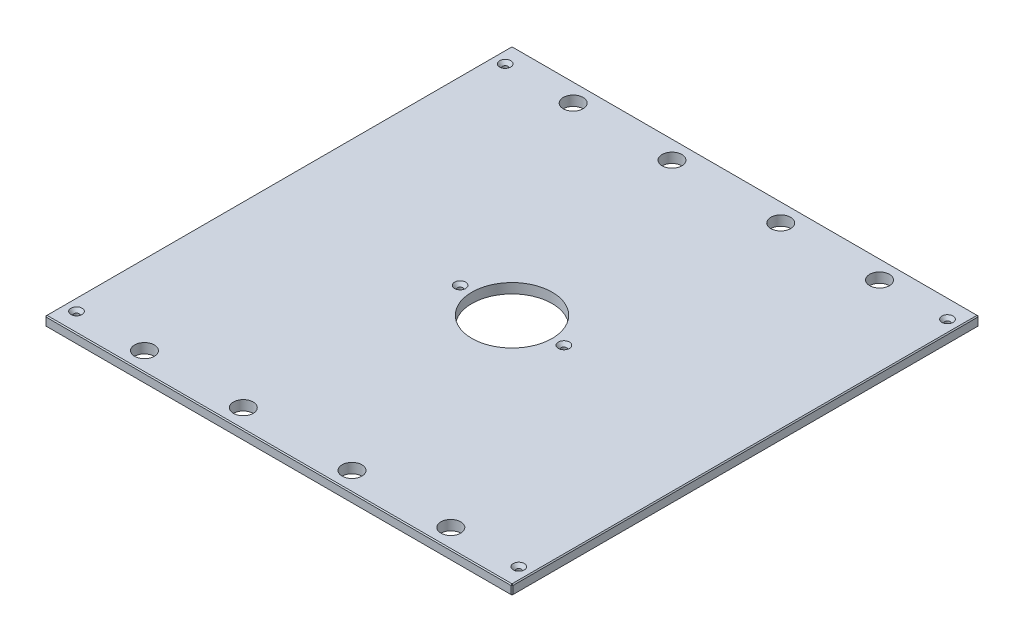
ISO-10303-21;
HEADER;
FILE_DESCRIPTION(('STEP AP214'),'2;1');
FILE_NAME('part.step','',(''),(''),'','','');
FILE_SCHEMA(('AUTOMOTIVE_DESIGN { 1 0 10303 214 1 1 1 1 }'));
ENDSEC;
DATA;
#1=APPLICATION_CONTEXT('core data for automotive mechanical design processes');
#2=APPLICATION_PROTOCOL_DEFINITION('international standard','automotive_design',2000,#1);
#3=PRODUCT_CONTEXT('',#1,'mechanical');
#4=PRODUCT('Part','Part','',(#3));
#5=PRODUCT_RELATED_PRODUCT_CATEGORY('part','',(#4));
#6=PRODUCT_DEFINITION_FORMATION('','',#4);
#7=PRODUCT_DEFINITION_CONTEXT('part definition',#1,'design');
#8=PRODUCT_DEFINITION('design','',#6,#7);
#9=PRODUCT_DEFINITION_SHAPE('','',#8);
#10=(LENGTH_UNIT() NAMED_UNIT(*) SI_UNIT(.MILLI.,.METRE.));
#11=(NAMED_UNIT(*) PLANE_ANGLE_UNIT() SI_UNIT($,.RADIAN.));
#12=(NAMED_UNIT(*) SI_UNIT($,.STERADIAN.) SOLID_ANGLE_UNIT());
#13=UNCERTAINTY_MEASURE_WITH_UNIT(LENGTH_MEASURE(1.E-05),#10,'distance_accuracy_value','');
#14=(GEOMETRIC_REPRESENTATION_CONTEXT(3) GLOBAL_UNCERTAINTY_ASSIGNED_CONTEXT((#13)) GLOBAL_UNIT_ASSIGNED_CONTEXT((#10,
#11,#12)) REPRESENTATION_CONTEXT('',''));
#15=CARTESIAN_POINT('',(0.,0.,0.));
#16=DIRECTION('',(0.,0.,1.));
#17=DIRECTION('',(1.,0.,0.));
#18=AXIS2_PLACEMENT_3D('',#15,#16,#17);
#19=CARTESIAN_POINT('',(-300.0375,12.7,-300.0375));
#20=DIRECTION('',(1.,0.,0.));
#21=DIRECTION('',(0.,0.,-1.));
#22=AXIS2_PLACEMENT_3D('',#19,#20,#21);
#23=PLANE('',#22);
#24=DIRECTION('',(0.,0.,-1.));
#25=VECTOR('',#24,1.);
#26=CARTESIAN_POINT('',(-300.0375,11.4299999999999,-300.0375));
#27=LINE('',#26,#25);
#28=CARTESIAN_POINT('',(-300.0375,11.4299999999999,298.7675));
#29=VERTEX_POINT('',#28);
#30=CARTESIAN_POINT('',(-300.0375,11.4299999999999,-298.7675));
#31=VERTEX_POINT('',#30);
#32=EDGE_CURVE('E135',#29,#31,#27,.T.);
#33=ORIENTED_EDGE('',*,*,#32,.T.);
#34=DIRECTION('',(0.,-1.,0.));
#35=VECTOR('',#34,1.);
#36=CARTESIAN_POINT('',(-300.0375,12.7,-298.7675));
#37=LINE('',#36,#35);
#38=CARTESIAN_POINT('',(-300.0375,1.2700000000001,-298.7675));
#39=VERTEX_POINT('',#38);
#40=EDGE_CURVE('E131',#31,#39,#37,.T.);
#41=ORIENTED_EDGE('',*,*,#40,.T.);
#42=DIRECTION('',(0.,0.,1.));
#43=VECTOR('',#42,1.);
#44=CARTESIAN_POINT('',(-300.0375,1.2700000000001,-300.0375));
#45=LINE('',#44,#43);
#46=CARTESIAN_POINT('',(-300.0375,1.2700000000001,298.7675));
#47=VERTEX_POINT('',#46);
#48=EDGE_CURVE('E126',#39,#47,#45,.T.);
#49=ORIENTED_EDGE('',*,*,#48,.T.);
#50=DIRECTION('',(0.,1.,0.));
#51=VECTOR('',#50,1.);
#52=CARTESIAN_POINT('',(-300.0375,12.7,298.7675));
#53=LINE('',#52,#51);
#54=EDGE_CURVE('E128',#47,#29,#53,.T.);
#55=ORIENTED_EDGE('',*,*,#54,.T.);
#56=EDGE_LOOP('',(#33,#41,#49,#55));
#57=FACE_BOUND('',#56,.T.);
#58=ADVANCED_FACE('F35',(#57),#23,.F.);
#59=CARTESIAN_POINT('',(-300.0375,12.7,300.0375));
#60=DIRECTION('',(0.,0.,-1.));
#61=DIRECTION('',(-1.,0.,0.));
#62=AXIS2_PLACEMENT_3D('',#59,#60,#61);
#63=PLANE('',#62);
#64=DIRECTION('',(1.,0.,0.));
#65=VECTOR('',#64,1.);
#66=CARTESIAN_POINT('',(-300.0375,1.2700000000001,300.0375));
#67=LINE('',#66,#65);
#68=CARTESIAN_POINT('',(-298.7675,1.2700000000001,300.0375));
#69=VERTEX_POINT('',#68);
#70=CARTESIAN_POINT('',(298.7675,1.2700000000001,300.0375));
#71=VERTEX_POINT('',#70);
#72=EDGE_CURVE('E58',#69,#71,#67,.T.);
#73=ORIENTED_EDGE('',*,*,#72,.T.);
#74=DIRECTION('',(0.,1.,0.));
#75=VECTOR('',#74,1.);
#76=CARTESIAN_POINT('',(298.7675,12.7,300.0375));
#77=LINE('',#76,#75);
#78=CARTESIAN_POINT('',(298.7675,11.4299999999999,300.0375));
#79=VERTEX_POINT('',#78);
#80=EDGE_CURVE('E11',#71,#79,#77,.T.);
#81=ORIENTED_EDGE('',*,*,#80,.T.);
#82=DIRECTION('',(-1.,0.,0.));
#83=VECTOR('',#82,1.);
#84=CARTESIAN_POINT('',(-300.0375,11.4299999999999,300.0375));
#85=LINE('',#84,#83);
#86=CARTESIAN_POINT('',(-298.7675,11.4299999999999,300.0375));
#87=VERTEX_POINT('',#86);
#88=EDGE_CURVE('E44',#79,#87,#85,.T.);
#89=ORIENTED_EDGE('',*,*,#88,.T.);
#90=DIRECTION('',(0.,-1.,0.));
#91=VECTOR('',#90,1.);
#92=CARTESIAN_POINT('',(-298.7675,12.7,300.0375));
#93=LINE('',#92,#91);
#94=EDGE_CURVE('E303',#87,#69,#93,.T.);
#95=ORIENTED_EDGE('',*,*,#94,.T.);
#96=EDGE_LOOP('',(#73,#81,#89,#95));
#97=FACE_BOUND('',#96,.T.);
#98=ADVANCED_FACE('F372',(#97),#63,.F.);
#99=CARTESIAN_POINT('',(300.0375,12.7,-300.0375));
#100=DIRECTION('',(-1.,0.,0.));
#101=DIRECTION('',(0.,0.,1.));
#102=AXIS2_PLACEMENT_3D('',#99,#100,#101);
#103=PLANE('',#102);
#104=DIRECTION('',(0.,0.,-1.));
#105=VECTOR('',#104,1.);
#106=CARTESIAN_POINT('',(300.0375,1.2700000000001,-300.0375));
#107=LINE('',#106,#105);
#108=CARTESIAN_POINT('',(300.0375,1.2700000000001,298.7675));
#109=VERTEX_POINT('',#108);
#110=CARTESIAN_POINT('',(300.0375,1.2700000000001,-298.7675));
#111=VERTEX_POINT('',#110);
#112=EDGE_CURVE('E298',#109,#111,#107,.T.);
#113=ORIENTED_EDGE('',*,*,#112,.T.);
#114=DIRECTION('',(0.,1.,0.));
#115=VECTOR('',#114,1.);
#116=CARTESIAN_POINT('',(300.0375,12.7,-298.7675));
#117=LINE('',#116,#115);
#118=CARTESIAN_POINT('',(300.0375,11.4299999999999,-298.7675));
#119=VERTEX_POINT('',#118);
#120=EDGE_CURVE('E300',#111,#119,#117,.T.);
#121=ORIENTED_EDGE('',*,*,#120,.T.);
#122=DIRECTION('',(0.,0.,1.));
#123=VECTOR('',#122,1.);
#124=CARTESIAN_POINT('',(300.0375,11.4299999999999,300.0375));
#125=LINE('',#124,#123);
#126=CARTESIAN_POINT('',(300.0375,11.4299999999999,298.7675));
#127=VERTEX_POINT('',#126);
#128=EDGE_CURVE('E296',#119,#127,#125,.T.);
#129=ORIENTED_EDGE('',*,*,#128,.T.);
#130=DIRECTION('',(0.,-1.,0.));
#131=VECTOR('',#130,1.);
#132=CARTESIAN_POINT('',(300.0375,12.7,298.7675));
#133=LINE('',#132,#131);
#134=EDGE_CURVE('E294',#127,#109,#133,.T.);
#135=ORIENTED_EDGE('',*,*,#134,.T.);
#136=EDGE_LOOP('',(#113,#121,#129,#135));
#137=FACE_BOUND('',#136,.T.);
#138=ADVANCED_FACE('F359',(#137),#103,.F.);
#139=CARTESIAN_POINT('',(-300.0375,12.7,-300.0375));
#140=DIRECTION('',(0.,0.,1.));
#141=DIRECTION('',(1.,0.,0.));
#142=AXIS2_PLACEMENT_3D('',#139,#140,#141);
#143=PLANE('',#142);
#144=DIRECTION('',(-1.,0.,0.));
#145=VECTOR('',#144,1.);
#146=CARTESIAN_POINT('',(-300.0375,1.2700000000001,-300.0375));
#147=LINE('',#146,#145);
#148=CARTESIAN_POINT('',(298.7675,1.2700000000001,-300.0375));
#149=VERTEX_POINT('',#148);
#150=CARTESIAN_POINT('',(-298.7675,1.2700000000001,-300.0375));
#151=VERTEX_POINT('',#150);
#152=EDGE_CURVE('E270',#149,#151,#147,.T.);
#153=ORIENTED_EDGE('',*,*,#152,.T.);
#154=DIRECTION('',(0.,1.,0.));
#155=VECTOR('',#154,1.);
#156=CARTESIAN_POINT('',(-298.7675,12.7,-300.0375));
#157=LINE('',#156,#155);
#158=CARTESIAN_POINT('',(-298.7675,11.4299999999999,-300.0375));
#159=VERTEX_POINT('',#158);
#160=EDGE_CURVE('E274',#151,#159,#157,.T.);
#161=ORIENTED_EDGE('',*,*,#160,.T.);
#162=DIRECTION('',(1.,0.,0.));
#163=VECTOR('',#162,1.);
#164=CARTESIAN_POINT('',(300.0375,11.4299999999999,-300.0375));
#165=LINE('',#164,#163);
#166=CARTESIAN_POINT('',(298.7675,11.4299999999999,-300.0375));
#167=VERTEX_POINT('',#166);
#168=EDGE_CURVE('E272',#159,#167,#165,.T.);
#169=ORIENTED_EDGE('',*,*,#168,.T.);
#170=DIRECTION('',(0.,-1.,0.));
#171=VECTOR('',#170,1.);
#172=CARTESIAN_POINT('',(298.7675,12.7,-300.0375));
#173=LINE('',#172,#171);
#174=EDGE_CURVE('E268',#167,#149,#173,.T.);
#175=ORIENTED_EDGE('',*,*,#174,.T.);
#176=EDGE_LOOP('',(#153,#161,#169,#175));
#177=FACE_BOUND('',#176,.T.);
#178=ADVANCED_FACE('F333',(#177),#143,.F.);
#179=CARTESIAN_POINT('',(0.,12.7,0.));
#180=DIRECTION('',(0.,1.,0.));
#181=DIRECTION('',(0.,0.,1.));
#182=AXIS2_PLACEMENT_3D('',#179,#180,#181);
#183=PLANE('',#182);
#184=CARTESIAN_POINT('',(284.1625,12.7,-275.42998));
#185=DIRECTION('',(0.,1.,0.));
#186=DIRECTION('',(0.,0.,1.));
#187=AXIS2_PLACEMENT_3D('',#184,#185,#186);
#188=CIRCLE('',#187,7.13740000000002);
#189=CARTESIAN_POINT('',(284.1625,12.7,-268.29258));
#190=VERTEX_POINT('',#189);
#191=EDGE_CURVE('E816',#190,#190,#188,.T.);
#192=ORIENTED_EDGE('',*,*,#191,.F.);
#193=EDGE_LOOP('',(#192));
#194=FACE_BOUND('',#193,.T.);
#195=CARTESIAN_POINT('',(284.1625,12.7,275.42998));
#196=DIRECTION('',(0.,1.,0.));
#197=DIRECTION('',(0.,0.,1.));
#198=AXIS2_PLACEMENT_3D('',#195,#196,#197);
#199=CIRCLE('',#198,7.13740000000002);
#200=CARTESIAN_POINT('',(284.1625,12.7,282.56738));
#201=VERTEX_POINT('',#200);
#202=EDGE_CURVE('E820',#201,#201,#199,.T.);
#203=ORIENTED_EDGE('',*,*,#202,.F.);
#204=EDGE_LOOP('',(#203));
#205=FACE_BOUND('',#204,.T.);
#206=CARTESIAN_POINT('',(-284.1625,12.7,275.42998));
#207=DIRECTION('',(0.,1.,0.));
#208=DIRECTION('',(0.,0.,1.));
#209=AXIS2_PLACEMENT_3D('',#206,#207,#208);
#210=CIRCLE('',#209,7.13740000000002);
#211=CARTESIAN_POINT('',(-284.1625,12.7,282.56738));
#212=VERTEX_POINT('',#211);
#213=EDGE_CURVE('E824',#212,#212,#210,.T.);
#214=ORIENTED_EDGE('',*,*,#213,.F.);
#215=EDGE_LOOP('',(#214));
#216=FACE_BOUND('',#215,.T.);
#217=CARTESIAN_POINT('',(-66.675,12.7,0.));
#218=DIRECTION('',(0.,1.,0.));
#219=DIRECTION('',(0.,0.,1.));
#220=AXIS2_PLACEMENT_3D('',#217,#218,#219);
#221=CIRCLE('',#220,7.1374);
#222=CARTESIAN_POINT('',(-66.675,12.7,7.1374));
#223=VERTEX_POINT('',#222);
#224=EDGE_CURVE('E828',#223,#223,#221,.T.);
#225=ORIENTED_EDGE('',*,*,#224,.F.);
#226=EDGE_LOOP('',(#225));
#227=FACE_BOUND('',#226,.T.);
#228=CARTESIAN_POINT('',(66.675,12.7,0.));
#229=DIRECTION('',(0.,1.,0.));
#230=DIRECTION('',(0.,0.,1.));
#231=AXIS2_PLACEMENT_3D('',#228,#229,#230);
#232=CIRCLE('',#231,7.1374);
#233=CARTESIAN_POINT('',(66.675,12.7,7.1374));
#234=VERTEX_POINT('',#233);
#235=EDGE_CURVE('E832',#234,#234,#232,.T.);
#236=ORIENTED_EDGE('',*,*,#235,.F.);
#237=EDGE_LOOP('',(#236));
#238=FACE_BOUND('',#237,.T.);
#239=CARTESIAN_POINT('',(-284.1625,12.7,-275.42998));
#240=DIRECTION('',(0.,1.,0.));
#241=DIRECTION('',(0.,0.,1.));
#242=AXIS2_PLACEMENT_3D('',#239,#240,#241);
#243=CIRCLE('',#242,7.13740000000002);
#244=CARTESIAN_POINT('',(-284.1625,12.7,-268.29258));
#245=VERTEX_POINT('',#244);
#246=EDGE_CURVE('E835',#245,#245,#243,.T.);
#247=ORIENTED_EDGE('',*,*,#246,.F.);
#248=EDGE_LOOP('',(#247));
#249=FACE_BOUND('',#248,.T.);
#250=DIRECTION('',(0.,0.,-1.));
#251=VECTOR('',#250,1.);
#252=CARTESIAN_POINT('',(298.7675,12.7,-300.0375));
#253=LINE('',#252,#251);
#254=CARTESIAN_POINT('',(298.7675,12.7,298.7675));
#255=VERTEX_POINT('',#254);
#256=CARTESIAN_POINT('',(298.7675,12.7,-298.7675));
#257=VERTEX_POINT('',#256);
#258=EDGE_CURVE('E281',#255,#257,#253,.T.);
#259=ORIENTED_EDGE('',*,*,#258,.T.);
#260=DIRECTION('',(-1.,0.,0.));
#261=VECTOR('',#260,1.);
#262=CARTESIAN_POINT('',(-300.0375,12.7,-298.7675));
#263=LINE('',#262,#261);
#264=CARTESIAN_POINT('',(-298.7675,12.7,-298.7675));
#265=VERTEX_POINT('',#264);
#266=EDGE_CURVE('E283',#257,#265,#263,.T.);
#267=ORIENTED_EDGE('',*,*,#266,.T.);
#268=DIRECTION('',(0.,0.,1.));
#269=VECTOR('',#268,1.);
#270=CARTESIAN_POINT('',(-298.7675,12.7,300.0375));
#271=LINE('',#270,#269);
#272=CARTESIAN_POINT('',(-298.7675,12.7,298.7675));
#273=VERTEX_POINT('',#272);
#274=EDGE_CURVE('E279',#265,#273,#271,.T.);
#275=ORIENTED_EDGE('',*,*,#274,.T.);
#276=DIRECTION('',(1.,0.,0.));
#277=VECTOR('',#276,1.);
#278=CARTESIAN_POINT('',(300.0375,12.7,298.7675));
#279=LINE('',#278,#277);
#280=EDGE_CURVE('E277',#273,#255,#279,.T.);
#281=ORIENTED_EDGE('',*,*,#280,.T.);
#282=EDGE_LOOP('',(#259,#267,#275,#281));
#283=FACE_BOUND('',#282,.T.);
#284=CARTESIAN_POINT('',(196.85,12.7,-275.42998));
#285=DIRECTION('',(0.,1.,0.));
#286=DIRECTION('',(0.,0.,1.));
#287=AXIS2_PLACEMENT_3D('',#284,#285,#286);
#288=CIRCLE('',#287,12.7);
#289=CARTESIAN_POINT('',(196.85,12.7,-262.72998));
#290=VERTEX_POINT('',#289);
#291=EDGE_CURVE('E204',#290,#290,#288,.T.);
#292=ORIENTED_EDGE('',*,*,#291,.F.);
#293=EDGE_LOOP('',(#292));
#294=FACE_BOUND('',#293,.T.);
#295=CARTESIAN_POINT('',(-196.85,12.7,-275.42998));
#296=DIRECTION('',(0.,1.,0.));
#297=DIRECTION('',(0.,0.,1.));
#298=AXIS2_PLACEMENT_3D('',#295,#296,#297);
#299=CIRCLE('',#298,12.7);
#300=CARTESIAN_POINT('',(-196.85,12.7,-262.72998));
#301=VERTEX_POINT('',#300);
#302=EDGE_CURVE('E214',#301,#301,#299,.T.);
#303=ORIENTED_EDGE('',*,*,#302,.F.);
#304=EDGE_LOOP('',(#303));
#305=FACE_BOUND('',#304,.T.);
#306=CARTESIAN_POINT('',(196.85,12.7,275.42998));
#307=DIRECTION('',(0.,1.,0.));
#308=DIRECTION('',(0.,0.,1.));
#309=AXIS2_PLACEMENT_3D('',#306,#307,#308);
#310=CIRCLE('',#309,12.7);
#311=CARTESIAN_POINT('',(196.85,12.7,288.12998));
#312=VERTEX_POINT('',#311);
#313=EDGE_CURVE('E225',#312,#312,#310,.T.);
#314=ORIENTED_EDGE('',*,*,#313,.F.);
#315=EDGE_LOOP('',(#314));
#316=FACE_BOUND('',#315,.T.);
#317=CARTESIAN_POINT('',(-196.85,12.7,275.42998));
#318=DIRECTION('',(0.,1.,0.));
#319=DIRECTION('',(0.,0.,1.));
#320=AXIS2_PLACEMENT_3D('',#317,#318,#319);
#321=CIRCLE('',#320,12.7);
#322=CARTESIAN_POINT('',(-196.85,12.7,288.12998));
#323=VERTEX_POINT('',#322);
#324=EDGE_CURVE('E231',#323,#323,#321,.T.);
#325=ORIENTED_EDGE('',*,*,#324,.F.);
#326=EDGE_LOOP('',(#325));
#327=FACE_BOUND('',#326,.T.);
#328=CARTESIAN_POINT('',(-69.85,12.7,-275.42998));
#329=DIRECTION('',(0.,1.,0.));
#330=DIRECTION('',(0.,0.,1.));
#331=AXIS2_PLACEMENT_3D('',#328,#329,#330);
#332=CIRCLE('',#331,12.7);
#333=CARTESIAN_POINT('',(-69.85,12.7,-262.72998));
#334=VERTEX_POINT('',#333);
#335=EDGE_CURVE('E237',#334,#334,#332,.T.);
#336=ORIENTED_EDGE('',*,*,#335,.F.);
#337=EDGE_LOOP('',(#336));
#338=FACE_BOUND('',#337,.T.);
#339=CARTESIAN_POINT('',(69.85,12.7,-275.42998));
#340=DIRECTION('',(0.,1.,0.));
#341=DIRECTION('',(0.,0.,1.));
#342=AXIS2_PLACEMENT_3D('',#339,#340,#341);
#343=CIRCLE('',#342,12.7);
#344=CARTESIAN_POINT('',(69.85,12.7,-262.72998));
#345=VERTEX_POINT('',#344);
#346=EDGE_CURVE('E243',#345,#345,#343,.T.);
#347=ORIENTED_EDGE('',*,*,#346,.F.);
#348=EDGE_LOOP('',(#347));
#349=FACE_BOUND('',#348,.T.);
#350=CARTESIAN_POINT('',(69.85,12.7,275.42998));
#351=DIRECTION('',(0.,1.,0.));
#352=DIRECTION('',(0.,0.,1.));
#353=AXIS2_PLACEMENT_3D('',#350,#351,#352);
#354=CIRCLE('',#353,12.7);
#355=CARTESIAN_POINT('',(69.85,12.7,288.12998));
#356=VERTEX_POINT('',#355);
#357=EDGE_CURVE('E249',#356,#356,#354,.T.);
#358=ORIENTED_EDGE('',*,*,#357,.F.);
#359=EDGE_LOOP('',(#358));
#360=FACE_BOUND('',#359,.T.);
#361=CARTESIAN_POINT('',(-69.85,12.7,275.42998));
#362=DIRECTION('',(0.,1.,0.));
#363=DIRECTION('',(0.,0.,1.));
#364=AXIS2_PLACEMENT_3D('',#361,#362,#363);
#365=CIRCLE('',#364,12.7);
#366=CARTESIAN_POINT('',(-69.85,12.7,288.12998));
#367=VERTEX_POINT('',#366);
#368=EDGE_CURVE('E255',#367,#367,#365,.T.);
#369=ORIENTED_EDGE('',*,*,#368,.F.);
#370=EDGE_LOOP('',(#369));
#371=FACE_BOUND('',#370,.T.);
#372=CARTESIAN_POINT('',(0.,12.7,0.));
#373=DIRECTION('',(0.,1.,0.));
#374=DIRECTION('',(0.,0.,1.));
#375=AXIS2_PLACEMENT_3D('',#372,#373,#374);
#376=CIRCLE('',#375,51.562);
#377=CARTESIAN_POINT('',(0.,12.7,51.562));
#378=VERTEX_POINT('',#377);
#379=EDGE_CURVE('E261',#378,#378,#376,.T.);
#380=ORIENTED_EDGE('',*,*,#379,.F.);
#381=EDGE_LOOP('',(#380));
#382=FACE_BOUND('',#381,.T.);
#383=ADVANCED_FACE('F381',(#194,#205,#216,#227,#238,#249,#283,#294,#305,#316,#327,#338,#349,
#360,#371,#382),#183,.T.);
#384=CARTESIAN_POINT('',(0.,0.,0.));
#385=DIRECTION('',(0.,1.,0.));
#386=DIRECTION('',(0.,0.,1.));
#387=AXIS2_PLACEMENT_3D('',#384,#385,#386);
#388=PLANE('',#387);
#389=CARTESIAN_POINT('',(284.1625,0.,-275.42998));
#390=DIRECTION('',(0.,1.,0.));
#391=DIRECTION('',(0.,0.,1.));
#392=AXIS2_PLACEMENT_3D('',#389,#390,#391);
#393=CIRCLE('',#392,3.3782);
#394=CARTESIAN_POINT('',(284.1625,0.,-272.05178));
#395=VERTEX_POINT('',#394);
#396=EDGE_CURVE('E869',#395,#395,#393,.T.);
#397=ORIENTED_EDGE('',*,*,#396,.T.);
#398=EDGE_LOOP('',(#397));
#399=FACE_BOUND('',#398,.T.);
#400=CARTESIAN_POINT('',(284.1625,0.,275.42998));
#401=DIRECTION('',(0.,1.,0.));
#402=DIRECTION('',(0.,0.,1.));
#403=AXIS2_PLACEMENT_3D('',#400,#401,#402);
#404=CIRCLE('',#403,3.3782);
#405=CARTESIAN_POINT('',(284.1625,0.,278.80818));
#406=VERTEX_POINT('',#405);
#407=EDGE_CURVE('E862',#406,#406,#404,.T.);
#408=ORIENTED_EDGE('',*,*,#407,.T.);
#409=EDGE_LOOP('',(#408));
#410=FACE_BOUND('',#409,.T.);
#411=CARTESIAN_POINT('',(-284.1625,0.,275.42998));
#412=DIRECTION('',(0.,1.,0.));
#413=DIRECTION('',(0.,0.,1.));
#414=AXIS2_PLACEMENT_3D('',#411,#412,#413);
#415=CIRCLE('',#414,3.3782);
#416=CARTESIAN_POINT('',(-284.1625,0.,278.80818));
#417=VERTEX_POINT('',#416);
#418=EDGE_CURVE('E855',#417,#417,#415,.T.);
#419=ORIENTED_EDGE('',*,*,#418,.T.);
#420=EDGE_LOOP('',(#419));
#421=FACE_BOUND('',#420,.T.);
#422=CARTESIAN_POINT('',(-66.675,0.,0.));
#423=DIRECTION('',(0.,1.,0.));
#424=DIRECTION('',(0.,0.,1.));
#425=AXIS2_PLACEMENT_3D('',#422,#423,#424);
#426=CIRCLE('',#425,3.3782);
#427=CARTESIAN_POINT('',(-66.675,0.,3.3782));
#428=VERTEX_POINT('',#427);
#429=EDGE_CURVE('E848',#428,#428,#426,.T.);
#430=ORIENTED_EDGE('',*,*,#429,.T.);
#431=EDGE_LOOP('',(#430));
#432=FACE_BOUND('',#431,.T.);
#433=CARTESIAN_POINT('',(66.675,0.,0.));
#434=DIRECTION('',(0.,1.,0.));
#435=DIRECTION('',(0.,0.,1.));
#436=AXIS2_PLACEMENT_3D('',#433,#434,#435);
#437=CIRCLE('',#436,3.3782);
#438=CARTESIAN_POINT('',(66.675,0.,3.3782));
#439=VERTEX_POINT('',#438);
#440=EDGE_CURVE('E838',#439,#439,#437,.T.);
#441=ORIENTED_EDGE('',*,*,#440,.T.);
#442=EDGE_LOOP('',(#441));
#443=FACE_BOUND('',#442,.T.);
#444=CARTESIAN_POINT('',(-284.1625,0.,-275.42998));
#445=DIRECTION('',(0.,1.,0.));
#446=DIRECTION('',(0.,0.,1.));
#447=AXIS2_PLACEMENT_3D('',#444,#445,#446);
#448=CIRCLE('',#447,3.3782);
#449=CARTESIAN_POINT('',(-284.1625,0.,-272.05178));
#450=VERTEX_POINT('',#449);
#451=EDGE_CURVE('E217',#450,#450,#448,.T.);
#452=ORIENTED_EDGE('',*,*,#451,.T.);
#453=EDGE_LOOP('',(#452));
#454=FACE_BOUND('',#453,.T.);
#455=DIRECTION('',(0.,0.,-1.));
#456=VECTOR('',#455,1.);
#457=CARTESIAN_POINT('',(-298.7675,0.,0.));
#458=LINE('',#457,#456);
#459=CARTESIAN_POINT('',(-298.7675,0.,298.7675));
#460=VERTEX_POINT('',#459);
#461=CARTESIAN_POINT('',(-298.7675,0.,-298.7675));
#462=VERTEX_POINT('',#461);
#463=EDGE_CURVE('E158',#460,#462,#458,.T.);
#464=ORIENTED_EDGE('',*,*,#463,.T.);
#465=DIRECTION('',(1.,0.,0.));
#466=VECTOR('',#465,1.);
#467=CARTESIAN_POINT('',(0.,0.,-298.7675));
#468=LINE('',#467,#466);
#469=CARTESIAN_POINT('',(298.7675,0.,-298.7675));
#470=VERTEX_POINT('',#469);
#471=EDGE_CURVE('E291',#462,#470,#468,.T.);
#472=ORIENTED_EDGE('',*,*,#471,.T.);
#473=DIRECTION('',(0.,0.,1.));
#474=VECTOR('',#473,1.);
#475=CARTESIAN_POINT('',(298.7675,0.,0.));
#476=LINE('',#475,#474);
#477=CARTESIAN_POINT('',(298.7675,0.,298.7675));
#478=VERTEX_POINT('',#477);
#479=EDGE_CURVE('E289',#470,#478,#476,.T.);
#480=ORIENTED_EDGE('',*,*,#479,.T.);
#481=DIRECTION('',(-1.,0.,0.));
#482=VECTOR('',#481,1.);
#483=CARTESIAN_POINT('',(0.,0.,298.7675));
#484=LINE('',#483,#482);
#485=EDGE_CURVE('E286',#478,#460,#484,.T.);
#486=ORIENTED_EDGE('',*,*,#485,.T.);
#487=EDGE_LOOP('',(#464,#472,#480,#486));
#488=FACE_BOUND('',#487,.T.);
#489=CARTESIAN_POINT('',(196.85,0.,-275.42998));
#490=DIRECTION('',(0.,1.,0.));
#491=DIRECTION('',(0.,0.,1.));
#492=AXIS2_PLACEMENT_3D('',#489,#490,#491);
#493=CIRCLE('',#492,12.7);
#494=CARTESIAN_POINT('',(196.85,0.,-262.72998));
#495=VERTEX_POINT('',#494);
#496=EDGE_CURVE('E209',#495,#495,#493,.T.);
#497=ORIENTED_EDGE('',*,*,#496,.T.);
#498=EDGE_LOOP('',(#497));
#499=FACE_BOUND('',#498,.T.);
#500=CARTESIAN_POINT('',(-196.85,0.,-275.42998));
#501=DIRECTION('',(0.,1.,0.));
#502=DIRECTION('',(0.,0.,1.));
#503=AXIS2_PLACEMENT_3D('',#500,#501,#502);
#504=CIRCLE('',#503,12.7);
#505=CARTESIAN_POINT('',(-196.85,0.,-262.72998));
#506=VERTEX_POINT('',#505);
#507=EDGE_CURVE('E222',#506,#506,#504,.T.);
#508=ORIENTED_EDGE('',*,*,#507,.T.);
#509=EDGE_LOOP('',(#508));
#510=FACE_BOUND('',#509,.T.);
#511=CARTESIAN_POINT('',(196.85,0.,275.42998));
#512=DIRECTION('',(0.,1.,0.));
#513=DIRECTION('',(0.,0.,1.));
#514=AXIS2_PLACEMENT_3D('',#511,#512,#513);
#515=CIRCLE('',#514,12.7);
#516=CARTESIAN_POINT('',(196.85,0.,288.12998));
#517=VERTEX_POINT('',#516);
#518=EDGE_CURVE('E228',#517,#517,#515,.T.);
#519=ORIENTED_EDGE('',*,*,#518,.T.);
#520=EDGE_LOOP('',(#519));
#521=FACE_BOUND('',#520,.T.);
#522=CARTESIAN_POINT('',(-196.85,0.,275.42998));
#523=DIRECTION('',(0.,1.,0.));
#524=DIRECTION('',(0.,0.,1.));
#525=AXIS2_PLACEMENT_3D('',#522,#523,#524);
#526=CIRCLE('',#525,12.7);
#527=CARTESIAN_POINT('',(-196.85,0.,288.12998));
#528=VERTEX_POINT('',#527);
#529=EDGE_CURVE('E234',#528,#528,#526,.T.);
#530=ORIENTED_EDGE('',*,*,#529,.T.);
#531=EDGE_LOOP('',(#530));
#532=FACE_BOUND('',#531,.T.);
#533=CARTESIAN_POINT('',(-69.85,0.,-275.42998));
#534=DIRECTION('',(0.,1.,0.));
#535=DIRECTION('',(0.,0.,1.));
#536=AXIS2_PLACEMENT_3D('',#533,#534,#535);
#537=CIRCLE('',#536,12.7);
#538=CARTESIAN_POINT('',(-69.85,0.,-262.72998));
#539=VERTEX_POINT('',#538);
#540=EDGE_CURVE('E240',#539,#539,#537,.T.);
#541=ORIENTED_EDGE('',*,*,#540,.T.);
#542=EDGE_LOOP('',(#541));
#543=FACE_BOUND('',#542,.T.);
#544=CARTESIAN_POINT('',(69.85,0.,-275.42998));
#545=DIRECTION('',(0.,1.,0.));
#546=DIRECTION('',(0.,0.,1.));
#547=AXIS2_PLACEMENT_3D('',#544,#545,#546);
#548=CIRCLE('',#547,12.7);
#549=CARTESIAN_POINT('',(69.85,0.,-262.72998));
#550=VERTEX_POINT('',#549);
#551=EDGE_CURVE('E246',#550,#550,#548,.T.);
#552=ORIENTED_EDGE('',*,*,#551,.T.);
#553=EDGE_LOOP('',(#552));
#554=FACE_BOUND('',#553,.T.);
#555=CARTESIAN_POINT('',(69.85,0.,275.42998));
#556=DIRECTION('',(0.,1.,0.));
#557=DIRECTION('',(0.,0.,1.));
#558=AXIS2_PLACEMENT_3D('',#555,#556,#557);
#559=CIRCLE('',#558,12.7);
#560=CARTESIAN_POINT('',(69.85,0.,288.12998));
#561=VERTEX_POINT('',#560);
#562=EDGE_CURVE('E252',#561,#561,#559,.T.);
#563=ORIENTED_EDGE('',*,*,#562,.T.);
#564=EDGE_LOOP('',(#563));
#565=FACE_BOUND('',#564,.T.);
#566=CARTESIAN_POINT('',(-69.85,0.,275.42998));
#567=DIRECTION('',(0.,1.,0.));
#568=DIRECTION('',(0.,0.,1.));
#569=AXIS2_PLACEMENT_3D('',#566,#567,#568);
#570=CIRCLE('',#569,12.7);
#571=CARTESIAN_POINT('',(-69.85,0.,288.12998));
#572=VERTEX_POINT('',#571);
#573=EDGE_CURVE('E258',#572,#572,#570,.T.);
#574=ORIENTED_EDGE('',*,*,#573,.T.);
#575=EDGE_LOOP('',(#574));
#576=FACE_BOUND('',#575,.T.);
#577=CARTESIAN_POINT('',(0.,0.,0.));
#578=DIRECTION('',(0.,1.,0.));
#579=DIRECTION('',(0.,0.,1.));
#580=AXIS2_PLACEMENT_3D('',#577,#578,#579);
#581=CIRCLE('',#580,51.562);
#582=CARTESIAN_POINT('',(0.,0.,51.562));
#583=VERTEX_POINT('',#582);
#584=EDGE_CURVE('E147',#583,#583,#581,.T.);
#585=ORIENTED_EDGE('',*,*,#584,.T.);
#586=EDGE_LOOP('',(#585));
#587=FACE_BOUND('',#586,.T.);
#588=ADVANCED_FACE('F346',(#399,#410,#421,#432,#443,#454,#488,#499,#510,#521,#532,#543,#554,
#565,#576,#587),#388,.F.);
#589=CARTESIAN_POINT('',(0.,0.,0.));
#590=DIRECTION('',(0.,1.,0.));
#591=DIRECTION('',(0.,0.,1.));
#592=AXIS2_PLACEMENT_3D('',#589,#590,#591);
#593=CYLINDRICAL_SURFACE('',#592,51.562);
#594=ORIENTED_EDGE('',*,*,#584,.F.);
#595=EDGE_LOOP('',(#594));
#596=FACE_BOUND('',#595,.T.);
#597=ORIENTED_EDGE('',*,*,#379,.T.);
#598=EDGE_LOOP('',(#597));
#599=FACE_BOUND('',#598,.T.);
#600=ADVANCED_FACE('F751',(#596,#599),#593,.F.);
#601=CARTESIAN_POINT('',(-69.85,12.7,275.42998));
#602=DIRECTION('',(0.,1.,0.));
#603=DIRECTION('',(0.,0.,1.));
#604=AXIS2_PLACEMENT_3D('',#601,#602,#603);
#605=CYLINDRICAL_SURFACE('',#604,12.7);
#606=ORIENTED_EDGE('',*,*,#573,.F.);
#607=EDGE_LOOP('',(#606));
#608=FACE_BOUND('',#607,.T.);
#609=ORIENTED_EDGE('',*,*,#368,.T.);
#610=EDGE_LOOP('',(#609));
#611=FACE_BOUND('',#610,.T.);
#612=ADVANCED_FACE('F742',(#608,#611),#605,.F.);
#613=CARTESIAN_POINT('',(69.85,12.7,275.42998));
#614=DIRECTION('',(0.,1.,0.));
#615=DIRECTION('',(0.,0.,1.));
#616=AXIS2_PLACEMENT_3D('',#613,#614,#615);
#617=CYLINDRICAL_SURFACE('',#616,12.7);
#618=ORIENTED_EDGE('',*,*,#562,.F.);
#619=EDGE_LOOP('',(#618));
#620=FACE_BOUND('',#619,.T.);
#621=ORIENTED_EDGE('',*,*,#357,.T.);
#622=EDGE_LOOP('',(#621));
#623=FACE_BOUND('',#622,.T.);
#624=ADVANCED_FACE('F733',(#620,#623),#617,.F.);
#625=CARTESIAN_POINT('',(69.85,12.7,-275.42998));
#626=DIRECTION('',(0.,1.,0.));
#627=DIRECTION('',(0.,0.,1.));
#628=AXIS2_PLACEMENT_3D('',#625,#626,#627);
#629=CYLINDRICAL_SURFACE('',#628,12.7);
#630=ORIENTED_EDGE('',*,*,#551,.F.);
#631=EDGE_LOOP('',(#630));
#632=FACE_BOUND('',#631,.T.);
#633=ORIENTED_EDGE('',*,*,#346,.T.);
#634=EDGE_LOOP('',(#633));
#635=FACE_BOUND('',#634,.T.);
#636=ADVANCED_FACE('F724',(#632,#635),#629,.F.);
#637=CARTESIAN_POINT('',(-69.85,12.7,-275.42998));
#638=DIRECTION('',(0.,1.,0.));
#639=DIRECTION('',(0.,0.,1.));
#640=AXIS2_PLACEMENT_3D('',#637,#638,#639);
#641=CYLINDRICAL_SURFACE('',#640,12.7);
#642=ORIENTED_EDGE('',*,*,#540,.F.);
#643=EDGE_LOOP('',(#642));
#644=FACE_BOUND('',#643,.T.);
#645=ORIENTED_EDGE('',*,*,#335,.T.);
#646=EDGE_LOOP('',(#645));
#647=FACE_BOUND('',#646,.T.);
#648=ADVANCED_FACE('F715',(#644,#647),#641,.F.);
#649=CARTESIAN_POINT('',(-196.85,12.7,275.42998));
#650=DIRECTION('',(0.,1.,0.));
#651=DIRECTION('',(0.,0.,1.));
#652=AXIS2_PLACEMENT_3D('',#649,#650,#651);
#653=CYLINDRICAL_SURFACE('',#652,12.7);
#654=ORIENTED_EDGE('',*,*,#529,.F.);
#655=EDGE_LOOP('',(#654));
#656=FACE_BOUND('',#655,.T.);
#657=ORIENTED_EDGE('',*,*,#324,.T.);
#658=EDGE_LOOP('',(#657));
#659=FACE_BOUND('',#658,.T.);
#660=ADVANCED_FACE('F706',(#656,#659),#653,.F.);
#661=CARTESIAN_POINT('',(196.85,12.7,275.42998));
#662=DIRECTION('',(0.,1.,0.));
#663=DIRECTION('',(0.,0.,1.));
#664=AXIS2_PLACEMENT_3D('',#661,#662,#663);
#665=CYLINDRICAL_SURFACE('',#664,12.7);
#666=ORIENTED_EDGE('',*,*,#518,.F.);
#667=EDGE_LOOP('',(#666));
#668=FACE_BOUND('',#667,.T.);
#669=ORIENTED_EDGE('',*,*,#313,.T.);
#670=EDGE_LOOP('',(#669));
#671=FACE_BOUND('',#670,.T.);
#672=ADVANCED_FACE('F697',(#668,#671),#665,.F.);
#673=CARTESIAN_POINT('',(-196.85,12.7,-275.42998));
#674=DIRECTION('',(0.,1.,0.));
#675=DIRECTION('',(0.,0.,1.));
#676=AXIS2_PLACEMENT_3D('',#673,#674,#675);
#677=CYLINDRICAL_SURFACE('',#676,12.7);
#678=ORIENTED_EDGE('',*,*,#507,.F.);
#679=EDGE_LOOP('',(#678));
#680=FACE_BOUND('',#679,.T.);
#681=ORIENTED_EDGE('',*,*,#302,.T.);
#682=EDGE_LOOP('',(#681));
#683=FACE_BOUND('',#682,.T.);
#684=ADVANCED_FACE('F687',(#680,#683),#677,.F.);
#685=CARTESIAN_POINT('',(196.85,12.7,-275.42998));
#686=DIRECTION('',(0.,1.,0.));
#687=DIRECTION('',(0.,0.,1.));
#688=AXIS2_PLACEMENT_3D('',#685,#686,#687);
#689=CYLINDRICAL_SURFACE('',#688,12.7);
#690=ORIENTED_EDGE('',*,*,#496,.F.);
#691=EDGE_LOOP('',(#690));
#692=FACE_BOUND('',#691,.T.);
#693=ORIENTED_EDGE('',*,*,#291,.T.);
#694=EDGE_LOOP('',(#693));
#695=FACE_BOUND('',#694,.T.);
#696=ADVANCED_FACE('F390',(#692,#695),#689,.F.);
#697=CARTESIAN_POINT('',(300.0375,12.7,298.7675));
#698=DIRECTION('',(-0.707106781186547,0.,-0.707106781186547));
#699=DIRECTION('',(0.,-1.,0.));
#700=AXIS2_PLACEMENT_3D('',#697,#698,#699);
#701=PLANE('',#700);
#702=DIRECTION('',(-0.707106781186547,0.,0.707106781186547));
#703=VECTOR('',#702,1.);
#704=CARTESIAN_POINT('',(300.0375,11.4299999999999,298.7675));
#705=LINE('',#704,#703);
#706=EDGE_CURVE('E39',#79,#127,#705,.F.);
#707=ORIENTED_EDGE('',*,*,#706,.F.);
#708=ORIENTED_EDGE('',*,*,#80,.F.);
#709=DIRECTION('',(0.707106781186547,0.,-0.707106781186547));
#710=VECTOR('',#709,1.);
#711=CARTESIAN_POINT('',(299.4025,1.2700000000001,299.4025));
#712=LINE('',#711,#710);
#713=EDGE_CURVE('E197',#109,#71,#712,.F.);
#714=ORIENTED_EDGE('',*,*,#713,.F.);
#715=ORIENTED_EDGE('',*,*,#134,.F.);
#716=EDGE_LOOP('',(#707,#708,#714,#715));
#717=FACE_BOUND('',#716,.T.);
#718=ADVANCED_FACE('F37',(#717),#701,.F.);
#719=CARTESIAN_POINT('',(300.0375,11.4299999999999,298.7675));
#720=DIRECTION('',(0.577350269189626,0.577350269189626,0.577350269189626));
#721=DIRECTION('',(0.707106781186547,0.,-0.707106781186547));
#722=AXIS2_PLACEMENT_3D('',#719,#720,#721);
#723=PLANE('',#722);
#724=DIRECTION('',(0.,-0.707106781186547,0.707106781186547));
#725=VECTOR('',#724,1.);
#726=CARTESIAN_POINT('',(298.7675,12.0649999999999,299.4025));
#727=LINE('',#726,#725);
#728=EDGE_CURVE('E193',#79,#255,#727,.F.);
#729=ORIENTED_EDGE('',*,*,#728,.F.);
#730=ORIENTED_EDGE('',*,*,#706,.T.);
#731=DIRECTION('',(-0.707106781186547,0.707106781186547,0.));
#732=VECTOR('',#731,1.);
#733=CARTESIAN_POINT('',(300.0375,11.4299999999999,298.7675));
#734=LINE('',#733,#732);
#735=EDGE_CURVE('E195',#255,#127,#734,.F.);
#736=ORIENTED_EDGE('',*,*,#735,.F.);
#737=EDGE_LOOP('',(#729,#730,#736));
#738=FACE_BOUND('',#737,.T.);
#739=ADVANCED_FACE('F383',(#738),#723,.T.);
#740=CARTESIAN_POINT('',(298.7675,0.,298.7675));
#741=DIRECTION('',(0.577350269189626,-0.577350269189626,0.577350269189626));
#742=DIRECTION('',(0.707106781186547,0.,-0.707106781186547));
#743=AXIS2_PLACEMENT_3D('',#740,#741,#742);
#744=PLANE('',#743);
#745=DIRECTION('',(-0.707106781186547,-0.707106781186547,0.));
#746=VECTOR('',#745,1.);
#747=CARTESIAN_POINT('',(298.7675,0.,298.7675));
#748=LINE('',#747,#746);
#749=EDGE_CURVE('E187',#109,#478,#748,.T.);
#750=ORIENTED_EDGE('',*,*,#749,.F.);
#751=ORIENTED_EDGE('',*,*,#713,.T.);
#752=DIRECTION('',(0.,0.707106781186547,0.707106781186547));
#753=VECTOR('',#752,1.);
#754=CARTESIAN_POINT('',(298.7675,0.,298.7675));
#755=LINE('',#754,#753);
#756=EDGE_CURVE('E190',#478,#71,#755,.T.);
#757=ORIENTED_EDGE('',*,*,#756,.F.);
#758=EDGE_LOOP('',(#750,#751,#757));
#759=FACE_BOUND('',#758,.T.);
#760=ADVANCED_FACE('F352',(#759),#744,.T.);
#761=CARTESIAN_POINT('',(298.7675,12.7,0.));
#762=DIRECTION('',(0.707106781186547,0.707106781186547,0.));
#763=DIRECTION('',(0.,0.,1.));
#764=AXIS2_PLACEMENT_3D('',#761,#762,#763);
#765=PLANE('',#764);
#766=ORIENTED_EDGE('',*,*,#735,.T.);
#767=ORIENTED_EDGE('',*,*,#128,.F.);
#768=DIRECTION('',(0.707106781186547,-0.707106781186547,0.));
#769=VECTOR('',#768,1.);
#770=CARTESIAN_POINT('',(299.4025,12.0649999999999,-298.7675));
#771=LINE('',#770,#769);
#772=EDGE_CURVE('E182',#257,#119,#771,.T.);
#773=ORIENTED_EDGE('',*,*,#772,.F.);
#774=ORIENTED_EDGE('',*,*,#258,.F.);
#775=EDGE_LOOP('',(#766,#767,#773,#774));
#776=FACE_BOUND('',#775,.T.);
#777=ADVANCED_FACE('F369',(#776),#765,.T.);
#778=CARTESIAN_POINT('',(0.,12.7,298.7675));
#779=DIRECTION('',(0.,0.707106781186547,0.707106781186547));
#780=DIRECTION('',(-1.,0.,0.));
#781=AXIS2_PLACEMENT_3D('',#778,#779,#780);
#782=PLANE('',#781);
#783=ORIENTED_EDGE('',*,*,#728,.T.);
#784=ORIENTED_EDGE('',*,*,#280,.F.);
#785=DIRECTION('',(0.,0.707106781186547,-0.707106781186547));
#786=VECTOR('',#785,1.);
#787=CARTESIAN_POINT('',(-298.7675,12.7,298.7675));
#788=LINE('',#787,#786);
#789=EDGE_CURVE('E179',#87,#273,#788,.T.);
#790=ORIENTED_EDGE('',*,*,#789,.F.);
#791=ORIENTED_EDGE('',*,*,#88,.F.);
#792=EDGE_LOOP('',(#783,#784,#790,#791));
#793=FACE_BOUND('',#792,.T.);
#794=ADVANCED_FACE('F374',(#793),#782,.T.);
#795=CARTESIAN_POINT('',(-298.7675,12.7,300.0375));
#796=DIRECTION('',(0.707106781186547,0.,-0.707106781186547));
#797=DIRECTION('',(0.,-1.,0.));
#798=AXIS2_PLACEMENT_3D('',#795,#796,#797);
#799=PLANE('',#798);
#800=DIRECTION('',(0.707106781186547,0.,0.707106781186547));
#801=VECTOR('',#800,1.);
#802=CARTESIAN_POINT('',(-300.0375,1.2700000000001,298.7675));
#803=LINE('',#802,#801);
#804=EDGE_CURVE('E142',#69,#47,#803,.F.);
#805=ORIENTED_EDGE('',*,*,#804,.F.);
#806=ORIENTED_EDGE('',*,*,#94,.F.);
#807=DIRECTION('',(-0.707106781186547,0.,-0.707106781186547));
#808=VECTOR('',#807,1.);
#809=CARTESIAN_POINT('',(-299.4025,11.4299999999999,299.4025));
#810=LINE('',#809,#808);
#811=EDGE_CURVE('E145',#29,#87,#810,.F.);
#812=ORIENTED_EDGE('',*,*,#811,.F.);
#813=ORIENTED_EDGE('',*,*,#54,.F.);
#814=EDGE_LOOP('',(#805,#806,#812,#813));
#815=FACE_BOUND('',#814,.T.);
#816=ADVANCED_FACE('F140',(#815),#799,.F.);
#817=CARTESIAN_POINT('',(-300.0375,1.2700000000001,300.0375));
#818=DIRECTION('',(0.,0.707106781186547,-0.707106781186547));
#819=DIRECTION('',(1.,0.,0.));
#820=AXIS2_PLACEMENT_3D('',#817,#818,#819);
#821=PLANE('',#820);
#822=ORIENTED_EDGE('',*,*,#756,.T.);
#823=ORIENTED_EDGE('',*,*,#72,.F.);
#824=DIRECTION('',(0.,-0.707106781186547,-0.707106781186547));
#825=VECTOR('',#824,1.);
#826=CARTESIAN_POINT('',(-298.7675,0.635000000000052,299.4025));
#827=LINE('',#826,#825);
#828=EDGE_CURVE('E155',#460,#69,#827,.F.);
#829=ORIENTED_EDGE('',*,*,#828,.F.);
#830=ORIENTED_EDGE('',*,*,#485,.F.);
#831=EDGE_LOOP('',(#822,#823,#829,#830));
#832=FACE_BOUND('',#831,.T.);
#833=ADVANCED_FACE('F351',(#832),#821,.F.);
#834=CARTESIAN_POINT('',(300.0375,1.2700000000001,-300.0375));
#835=DIRECTION('',(-0.707106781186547,0.707106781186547,0.));
#836=DIRECTION('',(0.,0.,-1.));
#837=AXIS2_PLACEMENT_3D('',#834,#835,#836);
#838=PLANE('',#837);
#839=ORIENTED_EDGE('',*,*,#749,.T.);
#840=ORIENTED_EDGE('',*,*,#479,.F.);
#841=DIRECTION('',(0.707106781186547,0.707106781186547,0.));
#842=VECTOR('',#841,1.);
#843=CARTESIAN_POINT('',(298.7675,0.,-298.7675));
#844=LINE('',#843,#842);
#845=EDGE_CURVE('E174',#111,#470,#844,.F.);
#846=ORIENTED_EDGE('',*,*,#845,.F.);
#847=ORIENTED_EDGE('',*,*,#112,.F.);
#848=EDGE_LOOP('',(#839,#840,#846,#847));
#849=FACE_BOUND('',#848,.T.);
#850=ADVANCED_FACE('F356',(#849),#838,.F.);
#851=CARTESIAN_POINT('',(298.7675,12.7,-300.0375));
#852=DIRECTION('',(-0.707106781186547,0.,0.707106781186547));
#853=DIRECTION('',(0.,-1.,0.));
#854=AXIS2_PLACEMENT_3D('',#851,#852,#853);
#855=PLANE('',#854);
#856=DIRECTION('',(0.707106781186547,0.,0.707106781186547));
#857=VECTOR('',#856,1.);
#858=CARTESIAN_POINT('',(298.7675,11.4299999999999,-300.0375));
#859=LINE('',#858,#857);
#860=EDGE_CURVE('E184',#119,#167,#859,.F.);
#861=ORIENTED_EDGE('',*,*,#860,.F.);
#862=ORIENTED_EDGE('',*,*,#120,.F.);
#863=DIRECTION('',(-0.707106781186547,0.,-0.707106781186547));
#864=VECTOR('',#863,1.);
#865=CARTESIAN_POINT('',(299.4025,1.2700000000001,-299.4025));
#866=LINE('',#865,#864);
#867=EDGE_CURVE('E171',#149,#111,#866,.F.);
#868=ORIENTED_EDGE('',*,*,#867,.F.);
#869=ORIENTED_EDGE('',*,*,#174,.F.);
#870=EDGE_LOOP('',(#861,#862,#868,#869));
#871=FACE_BOUND('',#870,.T.);
#872=ADVANCED_FACE('F364',(#871),#855,.F.);
#873=CARTESIAN_POINT('',(298.7675,11.4299999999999,-300.0375));
#874=DIRECTION('',(0.577350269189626,0.577350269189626,-0.577350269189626));
#875=DIRECTION('',(-0.707106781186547,0.,-0.707106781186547));
#876=AXIS2_PLACEMENT_3D('',#873,#874,#875);
#877=PLANE('',#876);
#878=ORIENTED_EDGE('',*,*,#772,.T.);
#879=ORIENTED_EDGE('',*,*,#860,.T.);
#880=DIRECTION('',(0.,0.707106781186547,0.707106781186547));
#881=VECTOR('',#880,1.);
#882=CARTESIAN_POINT('',(298.7675,11.4299999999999,-300.0375));
#883=LINE('',#882,#881);
#884=EDGE_CURVE('E163',#257,#167,#883,.F.);
#885=ORIENTED_EDGE('',*,*,#884,.F.);
#886=EDGE_LOOP('',(#878,#879,#885));
#887=FACE_BOUND('',#886,.T.);
#888=ADVANCED_FACE('F422',(#887),#877,.T.);
#889=CARTESIAN_POINT('',(-298.7675,12.7,298.7675));
#890=DIRECTION('',(-0.577350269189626,0.577350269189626,0.577350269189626));
#891=DIRECTION('',(0.707106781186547,0.,0.707106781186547));
#892=AXIS2_PLACEMENT_3D('',#889,#890,#891);
#893=PLANE('',#892);
#894=ORIENTED_EDGE('',*,*,#811,.T.);
#895=ORIENTED_EDGE('',*,*,#789,.T.);
#896=DIRECTION('',(-0.707106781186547,-0.707106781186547,0.));
#897=VECTOR('',#896,1.);
#898=CARTESIAN_POINT('',(-298.7675,12.7,298.7675));
#899=LINE('',#898,#897);
#900=EDGE_CURVE('E159',#29,#273,#899,.F.);
#901=ORIENTED_EDGE('',*,*,#900,.F.);
#902=EDGE_LOOP('',(#894,#895,#901));
#903=FACE_BOUND('',#902,.T.);
#904=ADVANCED_FACE('F376',(#903),#893,.T.);
#905=CARTESIAN_POINT('',(-300.0375,1.2700000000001,298.7675));
#906=DIRECTION('',(-0.577350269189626,-0.577350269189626,0.577350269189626));
#907=DIRECTION('',(0.707106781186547,0.,0.707106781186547));
#908=AXIS2_PLACEMENT_3D('',#905,#906,#907);
#909=PLANE('',#908);
#910=ORIENTED_EDGE('',*,*,#828,.T.);
#911=ORIENTED_EDGE('',*,*,#804,.T.);
#912=DIRECTION('',(-0.707106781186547,0.707106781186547,0.));
#913=VECTOR('',#912,1.);
#914=CARTESIAN_POINT('',(-300.0375,1.2700000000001,298.7675));
#915=LINE('',#914,#913);
#916=EDGE_CURVE('E152',#460,#47,#915,.T.);
#917=ORIENTED_EDGE('',*,*,#916,.F.);
#918=EDGE_LOOP('',(#910,#911,#917));
#919=FACE_BOUND('',#918,.T.);
#920=ADVANCED_FACE('F151',(#919),#909,.T.);
#921=CARTESIAN_POINT('',(298.7675,0.,-298.7675));
#922=DIRECTION('',(0.577350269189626,-0.577350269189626,-0.577350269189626));
#923=DIRECTION('',(-0.707106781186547,0.,-0.707106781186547));
#924=AXIS2_PLACEMENT_3D('',#921,#922,#923);
#925=PLANE('',#924);
#926=ORIENTED_EDGE('',*,*,#867,.T.);
#927=ORIENTED_EDGE('',*,*,#845,.T.);
#928=DIRECTION('',(0.,-0.707106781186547,0.707106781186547));
#929=VECTOR('',#928,1.);
#930=CARTESIAN_POINT('',(298.7675,0.,-298.7675));
#931=LINE('',#930,#929);
#932=EDGE_CURVE('E160',#149,#470,#931,.T.);
#933=ORIENTED_EDGE('',*,*,#932,.F.);
#934=EDGE_LOOP('',(#926,#927,#933));
#935=FACE_BOUND('',#934,.T.);
#936=ADVANCED_FACE('F414',(#935),#925,.T.);
#937=CARTESIAN_POINT('',(0.,12.7,-298.7675));
#938=DIRECTION('',(0.,0.707106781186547,-0.707106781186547));
#939=DIRECTION('',(1.,0.,0.));
#940=AXIS2_PLACEMENT_3D('',#937,#938,#939);
#941=PLANE('',#940);
#942=ORIENTED_EDGE('',*,*,#884,.T.);
#943=ORIENTED_EDGE('',*,*,#168,.F.);
#944=DIRECTION('',(0.,-0.707106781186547,-0.707106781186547));
#945=VECTOR('',#944,1.);
#946=CARTESIAN_POINT('',(-298.7675,11.4299999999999,-300.0375));
#947=LINE('',#946,#945);
#948=EDGE_CURVE('E165',#265,#159,#947,.T.);
#949=ORIENTED_EDGE('',*,*,#948,.F.);
#950=ORIENTED_EDGE('',*,*,#266,.F.);
#951=EDGE_LOOP('',(#942,#943,#949,#950));
#952=FACE_BOUND('',#951,.T.);
#953=ADVANCED_FACE('F328',(#952),#941,.T.);
#954=CARTESIAN_POINT('',(-298.7675,12.7,0.));
#955=DIRECTION('',(-0.707106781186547,0.707106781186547,0.));
#956=DIRECTION('',(0.,0.,-1.));
#957=AXIS2_PLACEMENT_3D('',#954,#955,#956);
#958=PLANE('',#957);
#959=ORIENTED_EDGE('',*,*,#900,.T.);
#960=ORIENTED_EDGE('',*,*,#274,.F.);
#961=DIRECTION('',(0.707106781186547,0.707106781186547,0.));
#962=VECTOR('',#961,1.);
#963=CARTESIAN_POINT('',(-299.4025,12.0649999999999,-298.7675));
#964=LINE('',#963,#962);
#965=EDGE_CURVE('E317',#31,#265,#964,.T.);
#966=ORIENTED_EDGE('',*,*,#965,.F.);
#967=ORIENTED_EDGE('',*,*,#32,.F.);
#968=EDGE_LOOP('',(#959,#960,#966,#967));
#969=FACE_BOUND('',#968,.T.);
#970=ADVANCED_FACE('F379',(#969),#958,.T.);
#971=CARTESIAN_POINT('',(-300.0375,1.2700000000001,-300.0375));
#972=DIRECTION('',(0.707106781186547,0.707106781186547,0.));
#973=DIRECTION('',(0.,0.,1.));
#974=AXIS2_PLACEMENT_3D('',#971,#972,#973);
#975=PLANE('',#974);
#976=ORIENTED_EDGE('',*,*,#916,.T.);
#977=ORIENTED_EDGE('',*,*,#48,.F.);
#978=DIRECTION('',(0.707106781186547,-0.707106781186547,0.));
#979=VECTOR('',#978,1.);
#980=CARTESIAN_POINT('',(-300.0375,1.2700000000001,-298.7675));
#981=LINE('',#980,#979);
#982=EDGE_CURVE('E314',#462,#39,#981,.F.);
#983=ORIENTED_EDGE('',*,*,#982,.F.);
#984=ORIENTED_EDGE('',*,*,#463,.F.);
#985=EDGE_LOOP('',(#976,#977,#983,#984));
#986=FACE_BOUND('',#985,.T.);
#987=ADVANCED_FACE('F157',(#986),#975,.F.);
#988=CARTESIAN_POINT('',(-300.0375,1.2700000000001,-300.0375));
#989=DIRECTION('',(0.,0.707106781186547,0.707106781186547));
#990=DIRECTION('',(-1.,0.,0.));
#991=AXIS2_PLACEMENT_3D('',#988,#989,#990);
#992=PLANE('',#991);
#993=ORIENTED_EDGE('',*,*,#932,.T.);
#994=ORIENTED_EDGE('',*,*,#471,.F.);
#995=DIRECTION('',(0.,0.707106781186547,-0.707106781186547));
#996=VECTOR('',#995,1.);
#997=CARTESIAN_POINT('',(-298.7675,0.635000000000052,-299.4025));
#998=LINE('',#997,#996);
#999=EDGE_CURVE('E311',#151,#462,#998,.F.);
#1000=ORIENTED_EDGE('',*,*,#999,.F.);
#1001=ORIENTED_EDGE('',*,*,#152,.F.);
#1002=EDGE_LOOP('',(#993,#994,#1000,#1001));
#1003=FACE_BOUND('',#1002,.T.);
#1004=ADVANCED_FACE('F343',(#1003),#992,.F.);
#1005=CARTESIAN_POINT('',(-298.7675,11.4299999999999,-300.0375));
#1006=DIRECTION('',(-0.577350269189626,0.577350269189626,-0.577350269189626));
#1007=DIRECTION('',(-0.707106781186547,0.,0.707106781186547));
#1008=AXIS2_PLACEMENT_3D('',#1005,#1006,#1007);
#1009=PLANE('',#1008);
#1010=ORIENTED_EDGE('',*,*,#965,.T.);
#1011=ORIENTED_EDGE('',*,*,#948,.T.);
#1012=DIRECTION('',(0.707106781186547,0.,-0.707106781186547));
#1013=VECTOR('',#1012,1.);
#1014=CARTESIAN_POINT('',(-298.7675,11.4299999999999,-300.0375));
#1015=LINE('',#1014,#1013);
#1016=EDGE_CURVE('E309',#31,#159,#1015,.T.);
#1017=ORIENTED_EDGE('',*,*,#1016,.F.);
#1018=EDGE_LOOP('',(#1010,#1011,#1017));
#1019=FACE_BOUND('',#1018,.T.);
#1020=ADVANCED_FACE('F323',(#1019),#1009,.T.);
#1021=CARTESIAN_POINT('',(-300.0375,1.2700000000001,-298.7675));
#1022=DIRECTION('',(-0.577350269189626,-0.577350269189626,-0.577350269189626));
#1023=DIRECTION('',(-0.707106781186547,0.,0.707106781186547));
#1024=AXIS2_PLACEMENT_3D('',#1021,#1022,#1023);
#1025=PLANE('',#1024);
#1026=ORIENTED_EDGE('',*,*,#999,.T.);
#1027=ORIENTED_EDGE('',*,*,#982,.T.);
#1028=DIRECTION('',(-0.707106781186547,0.,0.707106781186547));
#1029=VECTOR('',#1028,1.);
#1030=CARTESIAN_POINT('',(-300.0375,1.2700000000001,-298.7675));
#1031=LINE('',#1030,#1029);
#1032=EDGE_CURVE('E307',#151,#39,#1031,.T.);
#1033=ORIENTED_EDGE('',*,*,#1032,.F.);
#1034=EDGE_LOOP('',(#1026,#1027,#1033));
#1035=FACE_BOUND('',#1034,.T.);
#1036=ADVANCED_FACE('F340',(#1035),#1025,.T.);
#1037=CARTESIAN_POINT('',(-300.0375,12.7,-298.7675));
#1038=DIRECTION('',(0.707106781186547,0.,0.707106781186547));
#1039=DIRECTION('',(0.,-1.,0.));
#1040=AXIS2_PLACEMENT_3D('',#1037,#1038,#1039);
#1041=PLANE('',#1040);
#1042=ORIENTED_EDGE('',*,*,#1016,.T.);
#1043=ORIENTED_EDGE('',*,*,#160,.F.);
#1044=ORIENTED_EDGE('',*,*,#1032,.T.);
#1045=ORIENTED_EDGE('',*,*,#40,.F.);
#1046=EDGE_LOOP('',(#1042,#1043,#1044,#1045));
#1047=FACE_BOUND('',#1046,.T.);
#1048=ADVANCED_FACE('F338',(#1047),#1041,.F.);
#1049=CARTESIAN_POINT('',(-284.1625,12.7,-275.42998));
#1050=DIRECTION('',(0.,1.,0.));
#1051=DIRECTION('',(0.,0.,1.));
#1052=AXIS2_PLACEMENT_3D('',#1049,#1050,#1051);
#1053=CYLINDRICAL_SURFACE('',#1052,3.3782);
#1054=ORIENTED_EDGE('',*,*,#451,.F.);
#1055=EDGE_LOOP('',(#1054));
#1056=FACE_BOUND('',#1055,.T.);
#1057=CARTESIAN_POINT('',(-284.1625,8.37553508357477,-275.42998));
#1058=DIRECTION('',(0.,1.,0.));
#1059=DIRECTION('',(0.,0.,1.));
#1060=AXIS2_PLACEMENT_3D('',#1057,#1058,#1059);
#1061=CIRCLE('',#1060,3.3782);
#1062=CARTESIAN_POINT('',(-284.1625,8.37553508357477,-272.05178));
#1063=VERTEX_POINT('',#1062);
#1064=EDGE_CURVE('E837',#1063,#1063,#1061,.T.);
#1065=ORIENTED_EDGE('',*,*,#1064,.T.);
#1066=EDGE_LOOP('',(#1065));
#1067=FACE_BOUND('',#1066,.T.);
#1068=ADVANCED_FACE('F401',(#1056,#1067),#1053,.F.);
#1069=CARTESIAN_POINT('',(-284.1625,12.7,-275.42998));
#1070=DIRECTION('',(0.,1.,0.));
#1071=DIRECTION('',(0.,0.,1.));
#1072=AXIS2_PLACEMENT_3D('',#1069,#1070,#1071);
#1073=CONICAL_SURFACE('',#1072,7.13740000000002,0.715584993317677);
#1074=ORIENTED_EDGE('',*,*,#1064,.F.);
#1075=EDGE_LOOP('',(#1074));
#1076=FACE_BOUND('',#1075,.T.);
#1077=ORIENTED_EDGE('',*,*,#246,.T.);
#1078=EDGE_LOOP('',(#1077));
#1079=FACE_BOUND('',#1078,.T.);
#1080=ADVANCED_FACE('F511',(#1076,#1079),#1073,.F.);
#1081=CARTESIAN_POINT('',(66.675,12.7,0.));
#1082=DIRECTION('',(0.,1.,0.));
#1083=DIRECTION('',(0.,0.,1.));
#1084=AXIS2_PLACEMENT_3D('',#1081,#1082,#1083);
#1085=CYLINDRICAL_SURFACE('',#1084,3.3782);
#1086=ORIENTED_EDGE('',*,*,#440,.F.);
#1087=EDGE_LOOP('',(#1086));
#1088=FACE_BOUND('',#1087,.T.);
#1089=CARTESIAN_POINT('',(66.675,8.37553508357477,0.));
#1090=DIRECTION('',(0.,1.,0.));
#1091=DIRECTION('',(0.,0.,1.));
#1092=AXIS2_PLACEMENT_3D('',#1089,#1090,#1091);
#1093=CIRCLE('',#1092,3.3782);
#1094=CARTESIAN_POINT('',(66.675,8.37553508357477,3.3782));
#1095=VERTEX_POINT('',#1094);
#1096=EDGE_CURVE('E842',#1095,#1095,#1093,.T.);
#1097=ORIENTED_EDGE('',*,*,#1096,.T.);
#1098=EDGE_LOOP('',(#1097));
#1099=FACE_BOUND('',#1098,.T.);
#1100=ADVANCED_FACE('F520',(#1088,#1099),#1085,.F.);
#1101=CARTESIAN_POINT('',(66.675,12.7,0.));
#1102=DIRECTION('',(0.,1.,0.));
#1103=DIRECTION('',(0.,0.,1.));
#1104=AXIS2_PLACEMENT_3D('',#1101,#1102,#1103);
#1105=CONICAL_SURFACE('',#1104,7.1374,0.715584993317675);
#1106=ORIENTED_EDGE('',*,*,#1096,.F.);
#1107=EDGE_LOOP('',(#1106));
#1108=FACE_BOUND('',#1107,.T.);
#1109=ORIENTED_EDGE('',*,*,#235,.T.);
#1110=EDGE_LOOP('',(#1109));
#1111=FACE_BOUND('',#1110,.T.);
#1112=ADVANCED_FACE('F528',(#1108,#1111),#1105,.F.);
#1113=CARTESIAN_POINT('',(-66.675,12.7,0.));
#1114=DIRECTION('',(0.,1.,0.));
#1115=DIRECTION('',(0.,0.,1.));
#1116=AXIS2_PLACEMENT_3D('',#1113,#1114,#1115);
#1117=CYLINDRICAL_SURFACE('',#1116,3.3782);
#1118=ORIENTED_EDGE('',*,*,#429,.F.);
#1119=EDGE_LOOP('',(#1118));
#1120=FACE_BOUND('',#1119,.T.);
#1121=CARTESIAN_POINT('',(-66.675,8.37553508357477,0.));
#1122=DIRECTION('',(0.,1.,0.));
#1123=DIRECTION('',(0.,0.,1.));
#1124=AXIS2_PLACEMENT_3D('',#1121,#1122,#1123);
#1125=CIRCLE('',#1124,3.3782);
#1126=CARTESIAN_POINT('',(-66.675,8.37553508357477,3.3782));
#1127=VERTEX_POINT('',#1126);
#1128=EDGE_CURVE('E851',#1127,#1127,#1125,.T.);
#1129=ORIENTED_EDGE('',*,*,#1128,.T.);
#1130=EDGE_LOOP('',(#1129));
#1131=FACE_BOUND('',#1130,.T.);
#1132=ADVANCED_FACE('F536',(#1120,#1131),#1117,.F.);
#1133=CARTESIAN_POINT('',(-66.675,12.7,0.));
#1134=DIRECTION('',(0.,1.,0.));
#1135=DIRECTION('',(0.,0.,1.));
#1136=AXIS2_PLACEMENT_3D('',#1133,#1134,#1135);
#1137=CONICAL_SURFACE('',#1136,7.1374,0.715584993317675);
#1138=ORIENTED_EDGE('',*,*,#1128,.F.);
#1139=EDGE_LOOP('',(#1138));
#1140=FACE_BOUND('',#1139,.T.);
#1141=ORIENTED_EDGE('',*,*,#224,.T.);
#1142=EDGE_LOOP('',(#1141));
#1143=FACE_BOUND('',#1142,.T.);
#1144=ADVANCED_FACE('F544',(#1140,#1143),#1137,.F.);
#1145=CARTESIAN_POINT('',(-284.1625,12.7,275.42998));
#1146=DIRECTION('',(0.,1.,0.));
#1147=DIRECTION('',(0.,0.,1.));
#1148=AXIS2_PLACEMENT_3D('',#1145,#1146,#1147);
#1149=CYLINDRICAL_SURFACE('',#1148,3.3782);
#1150=ORIENTED_EDGE('',*,*,#418,.F.);
#1151=EDGE_LOOP('',(#1150));
#1152=FACE_BOUND('',#1151,.T.);
#1153=CARTESIAN_POINT('',(-284.1625,8.37553508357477,275.42998));
#1154=DIRECTION('',(0.,1.,0.));
#1155=DIRECTION('',(0.,0.,1.));
#1156=AXIS2_PLACEMENT_3D('',#1153,#1154,#1155);
#1157=CIRCLE('',#1156,3.3782);
#1158=CARTESIAN_POINT('',(-284.1625,8.37553508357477,278.80818));
#1159=VERTEX_POINT('',#1158);
#1160=EDGE_CURVE('E858',#1159,#1159,#1157,.T.);
#1161=ORIENTED_EDGE('',*,*,#1160,.T.);
#1162=EDGE_LOOP('',(#1161));
#1163=FACE_BOUND('',#1162,.T.);
#1164=ADVANCED_FACE('F552',(#1152,#1163),#1149,.F.);
#1165=CARTESIAN_POINT('',(-284.1625,12.7,275.42998));
#1166=DIRECTION('',(0.,1.,0.));
#1167=DIRECTION('',(0.,0.,1.));
#1168=AXIS2_PLACEMENT_3D('',#1165,#1166,#1167);
#1169=CONICAL_SURFACE('',#1168,7.13740000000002,0.715584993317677);
#1170=ORIENTED_EDGE('',*,*,#1160,.F.);
#1171=EDGE_LOOP('',(#1170));
#1172=FACE_BOUND('',#1171,.T.);
#1173=ORIENTED_EDGE('',*,*,#213,.T.);
#1174=EDGE_LOOP('',(#1173));
#1175=FACE_BOUND('',#1174,.T.);
#1176=ADVANCED_FACE('F560',(#1172,#1175),#1169,.F.);
#1177=CARTESIAN_POINT('',(284.1625,12.7,275.42998));
#1178=DIRECTION('',(0.,1.,0.));
#1179=DIRECTION('',(0.,0.,1.));
#1180=AXIS2_PLACEMENT_3D('',#1177,#1178,#1179);
#1181=CYLINDRICAL_SURFACE('',#1180,3.3782);
#1182=ORIENTED_EDGE('',*,*,#407,.F.);
#1183=EDGE_LOOP('',(#1182));
#1184=FACE_BOUND('',#1183,.T.);
#1185=CARTESIAN_POINT('',(284.1625,8.37553508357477,275.42998));
#1186=DIRECTION('',(0.,1.,0.));
#1187=DIRECTION('',(0.,0.,1.));
#1188=AXIS2_PLACEMENT_3D('',#1185,#1186,#1187);
#1189=CIRCLE('',#1188,3.3782);
#1190=CARTESIAN_POINT('',(284.1625,8.37553508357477,278.80818));
#1191=VERTEX_POINT('',#1190);
#1192=EDGE_CURVE('E865',#1191,#1191,#1189,.T.);
#1193=ORIENTED_EDGE('',*,*,#1192,.T.);
#1194=EDGE_LOOP('',(#1193));
#1195=FACE_BOUND('',#1194,.T.);
#1196=ADVANCED_FACE('F568',(#1184,#1195),#1181,.F.);
#1197=CARTESIAN_POINT('',(284.1625,12.7,275.42998));
#1198=DIRECTION('',(0.,1.,0.));
#1199=DIRECTION('',(0.,0.,1.));
#1200=AXIS2_PLACEMENT_3D('',#1197,#1198,#1199);
#1201=CONICAL_SURFACE('',#1200,7.13740000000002,0.715584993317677);
#1202=ORIENTED_EDGE('',*,*,#1192,.F.);
#1203=EDGE_LOOP('',(#1202));
#1204=FACE_BOUND('',#1203,.T.);
#1205=ORIENTED_EDGE('',*,*,#202,.T.);
#1206=EDGE_LOOP('',(#1205));
#1207=FACE_BOUND('',#1206,.T.);
#1208=ADVANCED_FACE('F576',(#1204,#1207),#1201,.F.);
#1209=CARTESIAN_POINT('',(284.1625,12.7,-275.42998));
#1210=DIRECTION('',(0.,1.,0.));
#1211=DIRECTION('',(0.,0.,1.));
#1212=AXIS2_PLACEMENT_3D('',#1209,#1210,#1211);
#1213=CYLINDRICAL_SURFACE('',#1212,3.3782);
#1214=ORIENTED_EDGE('',*,*,#396,.F.);
#1215=EDGE_LOOP('',(#1214));
#1216=FACE_BOUND('',#1215,.T.);
#1217=CARTESIAN_POINT('',(284.1625,8.37553508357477,-275.42998));
#1218=DIRECTION('',(0.,1.,0.));
#1219=DIRECTION('',(0.,0.,1.));
#1220=AXIS2_PLACEMENT_3D('',#1217,#1218,#1219);
#1221=CIRCLE('',#1220,3.3782);
#1222=CARTESIAN_POINT('',(284.1625,8.37553508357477,-272.05178));
#1223=VERTEX_POINT('',#1222);
#1224=EDGE_CURVE('E872',#1223,#1223,#1221,.T.);
#1225=ORIENTED_EDGE('',*,*,#1224,.T.);
#1226=EDGE_LOOP('',(#1225));
#1227=FACE_BOUND('',#1226,.T.);
#1228=ADVANCED_FACE('F584',(#1216,#1227),#1213,.F.);
#1229=CARTESIAN_POINT('',(284.1625,12.7,-275.42998));
#1230=DIRECTION('',(0.,1.,0.));
#1231=DIRECTION('',(0.,0.,1.));
#1232=AXIS2_PLACEMENT_3D('',#1229,#1230,#1231);
#1233=CONICAL_SURFACE('',#1232,7.13740000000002,0.715584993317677);
#1234=ORIENTED_EDGE('',*,*,#1224,.F.);
#1235=EDGE_LOOP('',(#1234));
#1236=FACE_BOUND('',#1235,.T.);
#1237=ORIENTED_EDGE('',*,*,#191,.T.);
#1238=EDGE_LOOP('',(#1237));
#1239=FACE_BOUND('',#1238,.T.);
#1240=ADVANCED_FACE('F592',(#1236,#1239),#1233,.F.);
#1241=CLOSED_SHELL('',(#58,#98,#138,#178,#383,#588,#600,#612,#624,#636,#648,#660,#672,#684,#696,
#718,#739,#760,#777,#794,#816,#833,#850,#872,#888,#904,#920,#936,#953,#970,#987,#1004,#1020,
#1036,#1048,#1068,#1080,#1100,#1112,#1132,#1144,#1164,#1176,#1196,#1208,#1228,#1240));
#1242=MANIFOLD_SOLID_BREP('B2',#1241);
#1243=ADVANCED_BREP_SHAPE_REPRESENTATION('',(#18,#1242),#14);
#1244=SHAPE_DEFINITION_REPRESENTATION(#9,#1243);
ENDSEC;
END-ISO-10303-21;
